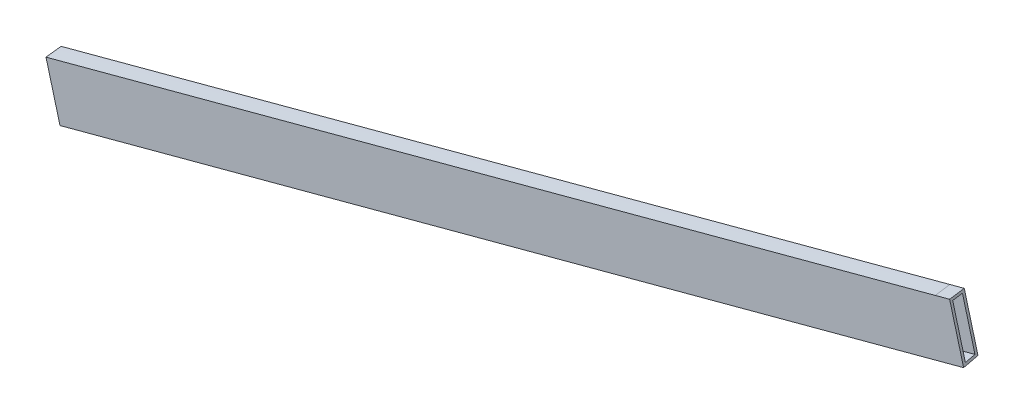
ISO-10303-21;
HEADER;
FILE_DESCRIPTION(('STEP AP214'),'2;1');
FILE_NAME('part.step','',(''),(''),'','','');
FILE_SCHEMA(('AUTOMOTIVE_DESIGN { 1 0 10303 214 1 1 1 1 }'));
ENDSEC;
DATA;
#1=APPLICATION_CONTEXT('core data for automotive mechanical design processes');
#2=APPLICATION_PROTOCOL_DEFINITION('international standard','automotive_design',2000,#1);
#3=PRODUCT_CONTEXT('',#1,'mechanical');
#4=PRODUCT('Part','Part','',(#3));
#5=PRODUCT_RELATED_PRODUCT_CATEGORY('part','',(#4));
#6=PRODUCT_DEFINITION_FORMATION('','',#4);
#7=PRODUCT_DEFINITION_CONTEXT('part definition',#1,'design');
#8=PRODUCT_DEFINITION('design','',#6,#7);
#9=PRODUCT_DEFINITION_SHAPE('','',#8);
#10=(LENGTH_UNIT() NAMED_UNIT(*) SI_UNIT(.MILLI.,.METRE.));
#11=(NAMED_UNIT(*) PLANE_ANGLE_UNIT() SI_UNIT($,.RADIAN.));
#12=(NAMED_UNIT(*) SI_UNIT($,.STERADIAN.) SOLID_ANGLE_UNIT());
#13=UNCERTAINTY_MEASURE_WITH_UNIT(LENGTH_MEASURE(1.E-05),#10,'distance_accuracy_value','');
#14=(GEOMETRIC_REPRESENTATION_CONTEXT(3) GLOBAL_UNCERTAINTY_ASSIGNED_CONTEXT((#13)) GLOBAL_UNIT_ASSIGNED_CONTEXT((#10,
#11,#12)) REPRESENTATION_CONTEXT('',''));
#15=CARTESIAN_POINT('',(0.,0.,0.));
#16=DIRECTION('',(0.,0.,1.));
#17=DIRECTION('',(1.,0.,0.));
#18=AXIS2_PLACEMENT_3D('',#15,#16,#17);
#19=CARTESIAN_POINT('',(25.4,18.2236431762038,-32.54375));
#20=CARTESIAN_POINT('',(310.61406,94.6465202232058,-32.54375));
#21=CARTESIAN_POINT('',(25.4,18.374784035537,-33.5991378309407));
#22=CARTESIAN_POINT('',(310.61406,94.797661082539,-33.5991378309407));
#23=CARTESIAN_POINT('',(25.4,18.5040045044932,-34.6579138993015));
#24=CARTESIAN_POINT('',(310.61406,94.9268815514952,-34.6579138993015));
#25=CARTESIAN_POINT('',(25.4,18.6103708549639,-35.71875));
#26=CARTESIAN_POINT('',(310.61406,95.0332479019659,-35.71875));
#27=B_SPLINE_SURFACE_WITH_KNOTS('',3,1,((#19,#20),(#21,#22),(#23,#24),(#25,#26)),.UNSPECIFIED.,
.F.,.F.,.F.,(4,4),(2,2),(0.,1.),(0.,1.),.UNSPECIFIED.);
#28=CARTESIAN_POINT('',(25.4753621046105,18.6305640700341,-35.71875));
#29=CARTESIAN_POINT('',(25.4820153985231,18.6057336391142,-35.4533282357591));
#30=CARTESIAN_POINT('',(25.4890260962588,18.5795693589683,-35.1880414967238));
#31=CARTESIAN_POINT('',(25.5037556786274,18.5245978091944,-34.6577616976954));
#32=CARTESIAN_POINT('',(25.5114745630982,18.4957905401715,-34.3927686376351));
#33=CARTESIAN_POINT('',(25.5356548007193,18.4055486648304,-33.5992094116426));
#34=CARTESIAN_POINT('',(25.5531635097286,18.3402052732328,-33.0711167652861));
#35=CARTESIAN_POINT('',(25.5720440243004,18.2697422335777,-32.54375));
#36=B_SPLINE_CURVE_WITH_KNOTS('',3,(#28,#29,#30,#31,#32,#33,#34,#35),.UNSPECIFIED.,.F.,.F.,(4,2,
2,4),(0.,0.799985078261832,1.59996997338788,3.19708769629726),.UNSPECIFIED.);
#37=CARTESIAN_POINT('',(25.4753621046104,18.6305640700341,-35.71875));
#38=VERTEX_POINT('',#37);
#39=CARTESIAN_POINT('',(25.5720440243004,18.2697422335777,-32.54375));
#40=VERTEX_POINT('',#39);
#41=EDGE_CURVE('E11',#38,#40,#36,.T.);
#42=DIRECTION('',(0.965925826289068,0.258819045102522,0.));
#43=VECTOR('',#42,1.);
#44=CARTESIAN_POINT('',(25.4,18.6103708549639,-35.71875));
#45=LINE('',#44,#43);
#46=CARTESIAN_POINT('',(306.268336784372,93.8688148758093,-35.71875));
#47=VERTEX_POINT('',#46);
#48=EDGE_CURVE('E239',#38,#47,#45,.T.);
#49=CARTESIAN_POINT('',(306.365018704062,93.5079930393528,-32.54375));
#50=CARTESIAN_POINT('',(306.355561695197,93.543287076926,-32.8078977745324));
#51=CARTESIAN_POINT('',(306.346448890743,93.5772965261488,-33.0722290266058));
#52=CARTESIAN_POINT('',(306.328918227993,93.6427218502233,-33.6012353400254));
#53=CARTESIAN_POINT('',(306.320500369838,93.6741377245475,-33.8659104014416));
#54=CARTESIAN_POINT('',(306.296327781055,93.7643510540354,-34.6594724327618));
#55=CARTESIAN_POINT('',(306.281620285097,93.8192401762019,-35.1888379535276));
#56=CARTESIAN_POINT('',(306.268336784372,93.8688148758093,-35.71875));
#57=B_SPLINE_CURVE_WITH_KNOTS('',3,(#49,#50,#51,#52,#53,#54,#55,#56),.UNSPECIFIED.,.F.,.F.,(4,2,
2,4),(0.,0.799984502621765,1.59996916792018,3.19708700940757),.UNSPECIFIED.);
#58=CARTESIAN_POINT('',(306.365018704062,93.5079930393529,-32.54375));
#59=VERTEX_POINT('',#58);
#60=EDGE_CURVE('E43',#59,#47,#57,.T.);
#61=DIRECTION('',(0.965925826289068,0.258819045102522,0.));
#62=VECTOR('',#61,1.);
#63=CARTESIAN_POINT('',(25.4,18.2236431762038,-32.54375));
#64=LINE('',#63,#62);
#65=EDGE_CURVE('E213',#40,#59,#64,.T.);
#66=ORIENTED_EDGE('',*,*,#41,.F.);
#67=ORIENTED_EDGE('',*,*,#48,.T.);
#68=ORIENTED_EDGE('',*,*,#60,.F.);
#69=ORIENTED_EDGE('',*,*,#65,.F.);
#70=EDGE_LOOP('',(#66,#67,#68,#69));
#71=FACE_BOUND('',#70,.T.);
#72=ADVANCED_FACE('F33',(#71),#27,.T.);
#73=CARTESIAN_POINT('',(25.4,18.2236431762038,-32.54375));
#74=DIRECTION('',(0.,0.,-1.));
#75=DIRECTION('',(-1.,0.,0.));
#76=AXIS2_PLACEMENT_3D('',#73,#74,#75);
#77=PLANE('',#76);
#78=DIRECTION('',(0.258819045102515,-0.96592582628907,0.));
#79=VECTOR('',#78,1.);
#80=CARTESIAN_POINT('',(25.5720440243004,18.2697422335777,-32.54375));
#81=LINE('',#80,#79);
#82=CARTESIAN_POINT('',(29.5814012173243,3.30661748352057,-32.54375));
#83=VERTEX_POINT('',#82);
#84=EDGE_CURVE('E214',#40,#83,#81,.T.);
#85=ORIENTED_EDGE('',*,*,#84,.F.);
#86=ORIENTED_EDGE('',*,*,#65,.T.);
#87=DIRECTION('',(-0.96592582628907,-0.258819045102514,0.));
#88=VECTOR('',#87,1.);
#89=CARTESIAN_POINT('',(310.903904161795,94.7241837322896,-32.54375));
#90=LINE('',#89,#88);
#91=CARTESIAN_POINT('',(310.903904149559,94.7241837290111,-32.54375));
#92=VERTEX_POINT('',#91);
#93=EDGE_CURVE('E170',#92,#59,#90,.T.);
#94=ORIENTED_EDGE('',*,*,#93,.F.);
#95=DIRECTION('',(0.258819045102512,-0.965925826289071,0.));
#96=VECTOR('',#95,1.);
#97=CARTESIAN_POINT('',(314.913261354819,79.7610589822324,-32.54375));
#98=LINE('',#97,#96);
#99=CARTESIAN_POINT('',(314.913261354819,79.7610589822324,-32.54375));
#100=VERTEX_POINT('',#99);
#101=EDGE_CURVE('E160',#92,#100,#98,.T.);
#102=ORIENTED_EDGE('',*,*,#101,.T.);
#103=DIRECTION('',(-0.96592582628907,-0.258819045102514,0.));
#104=VECTOR('',#103,1.);
#105=CARTESIAN_POINT('',(314.913261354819,79.7610589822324,-32.54375));
#106=LINE('',#105,#104);
#107=CARTESIAN_POINT('',(310.374375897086,78.5448682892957,-32.54375));
#108=VERTEX_POINT('',#107);
#109=EDGE_CURVE('E136',#100,#108,#106,.T.);
#110=ORIENTED_EDGE('',*,*,#109,.T.);
#111=DIRECTION('',(0.965925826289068,0.258819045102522,0.));
#112=VECTOR('',#111,1.);
#113=CARTESIAN_POINT('',(25.4,2.18621440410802,-32.54375));
#114=LINE('',#113,#112);
#115=EDGE_CURVE('E216',#83,#108,#114,.T.);
#116=ORIENTED_EDGE('',*,*,#115,.F.);
#117=EDGE_LOOP('',(#85,#86,#94,#102,#110,#116));
#118=FACE_BOUND('',#117,.T.);
#119=ADVANCED_FACE('F209',(#118),#77,.T.);
#120=CARTESIAN_POINT('',(25.4,2.78680767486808,-35.7187499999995));
#121=CARTESIAN_POINT('',(310.61406,79.2096847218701,-35.7187499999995));
#122=CARTESIAN_POINT('',(25.4,2.58767763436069,-34.6602152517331));
#123=CARTESIAN_POINT('',(310.61406,79.0105546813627,-34.6602152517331));
#124=CARTESIAN_POINT('',(25.4,2.3872384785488,-33.6019266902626));
#125=CARTESIAN_POINT('',(310.61406,78.8101155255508,-33.6019266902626));
#126=CARTESIAN_POINT('',(25.4,2.18621440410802,-32.54375));
#127=CARTESIAN_POINT('',(310.61406,78.60909145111,-32.54375));
#128=B_SPLINE_SURFACE_WITH_KNOTS('',3,1,((#120,#121),(#122,#123),(#124,#125),(#126,#127)),
.UNSPECIFIED.,.F.,.F.,.F.,(4,4),(2,2),(0.,1.),(0.,1.),.UNSPECIFIED.);
#129=CARTESIAN_POINT('',(29.5814012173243,3.30661748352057,-32.54375));
#130=CARTESIAN_POINT('',(29.568822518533,3.35356182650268,-32.8086035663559));
#131=CARTESIAN_POINT('',(29.5562530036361,3.40047189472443,-33.0734636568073));
#132=CARTESIAN_POINT('',(29.5311380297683,3.49420225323,-33.6032008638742));
#133=CARTESIAN_POINT('',(29.5185925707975,3.54102254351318,-33.8680779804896));
#134=CARTESIAN_POINT('',(29.481058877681,3.68110019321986,-34.6615133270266));
#135=CARTESIAN_POINT('',(29.4561149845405,3.77419206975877,-35.19010286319));
#136=CARTESIAN_POINT('',(29.4312528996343,3.86697863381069,-35.7187499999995));
#137=B_SPLINE_CURVE_WITH_KNOTS('',3,(#129,#130,#131,#132,#133,#134,#135,#136),.UNSPECIFIED.,.F.,
.F.,(4,2,2,4),(0.,0.807827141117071,1.61565428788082,3.22756506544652),.UNSPECIFIED.);
#138=CARTESIAN_POINT('',(29.4312528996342,3.86697863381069,-35.7187499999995));
#139=VERTEX_POINT('',#138);
#140=EDGE_CURVE('E408',#83,#139,#137,.T.);
#141=CARTESIAN_POINT('',(310.224227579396,79.1052294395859,-35.7187499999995));
#142=CARTESIAN_POINT('',(310.236687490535,79.0587284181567,-35.4538125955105));
#143=CARTESIAN_POINT('',(310.249167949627,79.0121507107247,-35.1888896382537));
#144=CARTESIAN_POINT('',(310.274164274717,78.9188631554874,-34.6590686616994));
#145=CARTESIAN_POINT('',(310.286680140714,78.8721533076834,-34.3941706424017));
#146=CARTESIAN_POINT('',(310.324214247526,78.732074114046,-33.6007355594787));
#147=CARTESIAN_POINT('',(310.349276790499,78.6385394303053,-33.072229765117));
#148=CARTESIAN_POINT('',(310.374375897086,78.5448682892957,-32.54375));
#149=B_SPLINE_CURVE_WITH_KNOTS('',3,(#141,#142,#143,#144,#145,#146,#147,#148),.UNSPECIFIED.,.F.,
.F.,(4,2,2,4),(0.,0.807827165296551,1.61565432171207,3.22756509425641),.UNSPECIFIED.);
#150=CARTESIAN_POINT('',(310.224227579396,79.1052294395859,-35.7187499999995));
#151=VERTEX_POINT('',#150);
#152=EDGE_CURVE('E37',#151,#108,#149,.T.);
#153=DIRECTION('',(0.965925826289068,0.258819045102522,0.));
#154=VECTOR('',#153,1.);
#155=CARTESIAN_POINT('',(25.4,2.78680767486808,-35.7187499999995));
#156=LINE('',#155,#154);
#157=EDGE_CURVE('E149',#139,#151,#156,.T.);
#158=ORIENTED_EDGE('',*,*,#140,.F.);
#159=ORIENTED_EDGE('',*,*,#115,.T.);
#160=ORIENTED_EDGE('',*,*,#152,.F.);
#161=ORIENTED_EDGE('',*,*,#157,.F.);
#162=EDGE_LOOP('',(#158,#159,#160,#161));
#163=FACE_BOUND('',#162,.T.);
#164=ADVANCED_FACE('F416',(#163),#128,.T.);
#165=CARTESIAN_POINT('',(25.4,2.78680767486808,-35.7187499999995));
#166=DIRECTION('',(0.,0.,1.));
#167=DIRECTION('',(0.,-1.,0.));
#168=AXIS2_PLACEMENT_3D('',#165,#166,#167);
#169=PLANE('',#168);
#170=DIRECTION('',(-0.258819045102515,0.96592582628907,0.));
#171=VECTOR('',#170,1.);
#172=CARTESIAN_POINT('',(29.4312528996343,3.86697863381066,-35.7187499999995));
#173=LINE('',#172,#171);
#174=EDGE_CURVE('E58',#139,#38,#173,.T.);
#175=ORIENTED_EDGE('',*,*,#174,.F.);
#176=ORIENTED_EDGE('',*,*,#157,.T.);
#177=DIRECTION('',(-0.96592582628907,-0.258819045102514,0.));
#178=VECTOR('',#177,1.);
#179=CARTESIAN_POINT('',(314.763113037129,80.3214201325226,-35.7187499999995));
#180=LINE('',#179,#178);
#181=CARTESIAN_POINT('',(314.763113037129,80.3214201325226,-35.7187499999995));
#182=VERTEX_POINT('',#181);
#183=EDGE_CURVE('E134',#182,#151,#180,.T.);
#184=ORIENTED_EDGE('',*,*,#183,.F.);
#185=DIRECTION('',(-0.258819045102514,0.96592582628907,0.));
#186=VECTOR('',#185,1.);
#187=CARTESIAN_POINT('',(310.807222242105,95.085005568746,-35.71875));
#188=LINE('',#187,#186);
#189=CARTESIAN_POINT('',(310.807222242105,95.085005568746,-35.71875));
#190=VERTEX_POINT('',#189);
#191=EDGE_CURVE('E141',#182,#190,#188,.T.);
#192=ORIENTED_EDGE('',*,*,#191,.T.);
#193=DIRECTION('',(-0.96592582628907,-0.258819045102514,0.));
#194=VECTOR('',#193,1.);
#195=CARTESIAN_POINT('',(310.807222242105,95.085005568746,-35.71875));
#196=LINE('',#195,#194);
#197=EDGE_CURVE('E152',#190,#47,#196,.T.);
#198=ORIENTED_EDGE('',*,*,#197,.T.);
#199=ORIENTED_EDGE('',*,*,#48,.F.);
#200=EDGE_LOOP('',(#175,#176,#184,#192,#198,#199));
#201=FACE_BOUND('',#200,.T.);
#202=ADVANCED_FACE('F145',(#201),#169,.T.);
#203=CARTESIAN_POINT('',(25.4,18.9118192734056,-57.15));
#204=DIRECTION('',(0.96592582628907,0.258819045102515,0.));
#205=DIRECTION('',(-0.258819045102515,0.96592582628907,0.));
#206=AXIS2_PLACEMENT_3D('',#203,#204,#205);
#207=PLANE('',#206);
#208=CARTESIAN_POINT('',(29.595841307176,3.25272633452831,-36.5124999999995));
#209=CARTESIAN_POINT('',(29.614531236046,3.18297457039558,-36.1150925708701));
#210=CARTESIAN_POINT('',(29.6332532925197,3.11310290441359,-35.7177077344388));
#211=CARTESIAN_POINT('',(29.6707518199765,2.9731564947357,-34.9229763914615));
#212=CARTESIAN_POINT('',(29.6895282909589,2.90308175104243,-34.5256298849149));
#213=CARTESIAN_POINT('',(29.745837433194,2.69293317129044,-33.3354791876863));
#214=CARTESIAN_POINT('',(29.7834365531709,2.55261134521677,-32.5427219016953));
#215=CARTESIAN_POINT('',(29.8210853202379,2.41210423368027,-31.75));
#216=B_SPLINE_CURVE_WITH_KNOTS('',3,(#208,#209,#210,#211,#212,#213,#214,#215),.UNSPECIFIED.,.F.,
.F.,(4,2,2,4),(0.,1.21174477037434,2.42348952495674,4.84136260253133),.UNSPECIFIED.);
#217=CARTESIAN_POINT('',(29.595841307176,3.25272633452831,-36.5124999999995));
#218=VERTEX_POINT('',#217);
#219=CARTESIAN_POINT('',(29.8210853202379,2.41210423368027,-31.75));
#220=VERTEX_POINT('',#219);
#221=EDGE_CURVE('E302',#218,#220,#216,.T.);
#222=ORIENTED_EDGE('',*,*,#221,.T.);
#223=DIRECTION('',(-0.258819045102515,0.96592582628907,0.));
#224=VECTOR('',#223,1.);
#225=CARTESIAN_POINT('',(25.4,18.9118192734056,-31.75));
#226=LINE('',#225,#224);
#227=CARTESIAN_POINT('',(25.4,18.9118192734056,-31.75));
#228=VERTEX_POINT('',#227);
#229=EDGE_CURVE('E304',#220,#228,#226,.T.);
#230=ORIENTED_EDGE('',*,*,#229,.T.);
#231=DIRECTION('',(0.,0.,1.));
#232=VECTOR('',#231,1.);
#233=CARTESIAN_POINT('',(25.4,18.9118192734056,-57.15));
#234=LINE('',#233,#232);
#235=CARTESIAN_POINT('',(25.4,18.9118192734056,-36.5124999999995));
#236=VERTEX_POINT('',#235);
#237=EDGE_CURVE('E305',#236,#228,#234,.T.);
#238=ORIENTED_EDGE('',*,*,#237,.F.);
#239=DIRECTION('',(0.258819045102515,-0.96592582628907,0.));
#240=VECTOR('',#239,1.);
#241=CARTESIAN_POINT('',(29.595841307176,3.25272633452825,-36.5124999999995));
#242=LINE('',#241,#240);
#243=EDGE_CURVE('E470',#236,#218,#242,.T.);
#244=ORIENTED_EDGE('',*,*,#243,.T.);
#245=EDGE_LOOP('',(#222,#230,#238,#244));
#246=FACE_BOUND('',#245,.T.);
#247=ORIENTED_EDGE('',*,*,#174,.T.);
#248=ORIENTED_EDGE('',*,*,#41,.T.);
#249=ORIENTED_EDGE('',*,*,#84,.T.);
#250=ORIENTED_EDGE('',*,*,#140,.T.);
#251=EDGE_LOOP('',(#247,#248,#249,#250));
#252=FACE_BOUND('',#251,.T.);
#253=ADVANCED_FACE('F249',(#246,#252),#207,.F.);
#254=CARTESIAN_POINT('',(25.4,19.4876873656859,-36.5124999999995));
#255=CARTESIAN_POINT('',(310.61406,95.9105644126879,-36.5124999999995));
#256=CARTESIAN_POINT('',(25.4,19.3281547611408,-34.9214146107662));
#257=CARTESIAN_POINT('',(310.61406,95.7510318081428,-34.9214146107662));
#258=CARTESIAN_POINT('',(25.4,19.1385065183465,-33.3329138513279));
#259=CARTESIAN_POINT('',(310.61406,95.5613835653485,-33.3329138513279));
#260=CARTESIAN_POINT('',(25.4,18.9118192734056,-31.75));
#261=CARTESIAN_POINT('',(310.61406,95.3346963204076,-31.75));
#262=B_SPLINE_SURFACE_WITH_KNOTS('',3,1,((#254,#255),(#256,#257),(#258,#259),(#260,#261)),
.UNSPECIFIED.,.F.,.F.,.F.,(4,4),(2,2),(0.,1.),(0.,1.),.UNSPECIFIED.);
#263=CARTESIAN_POINT('',(306.049007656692,94.6873623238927,-36.5124999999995));
#264=CARTESIAN_POINT('',(306.058986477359,94.650120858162,-36.1144127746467));
#265=CARTESIAN_POINT('',(306.069436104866,94.6111223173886,-35.7164993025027));
#266=CARTESIAN_POINT('',(306.091332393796,94.5294042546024,-34.9210819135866));
#267=CARTESIAN_POINT('',(306.102779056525,94.4866847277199,-34.5235779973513));
#268=CARTESIAN_POINT('',(306.138655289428,94.3527928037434,-33.333182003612));
#269=CARTESIAN_POINT('',(306.164656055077,94.2557566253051,-32.5409955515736));
#270=CARTESIAN_POINT('',(306.192974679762,94.1500700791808,-31.75));
#271=B_SPLINE_CURVE_WITH_KNOTS('',3,(#263,#264,#265,#266,#267,#268,#269,#270),.UNSPECIFIED.,.F.,
.F.,(4,2,2,4),(0.,1.19984922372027,2.39970001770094,4.79515275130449),.UNSPECIFIED.);
#272=CARTESIAN_POINT('',(306.049007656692,94.6873623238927,-36.5124999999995));
#273=VERTEX_POINT('',#272);
#274=CARTESIAN_POINT('',(306.192974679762,94.1500700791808,-31.75));
#275=VERTEX_POINT('',#274);
#276=EDGE_CURVE('E409',#273,#275,#271,.T.);
#277=DIRECTION('',(0.965925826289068,0.258819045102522,0.));
#278=VECTOR('',#277,1.);
#279=CARTESIAN_POINT('',(25.4,19.4876873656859,-36.5124999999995));
#280=LINE('',#279,#278);
#281=CARTESIAN_POINT('',(25.4,19.4876873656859,-36.5124999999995));
#282=VERTEX_POINT('',#281);
#283=EDGE_CURVE('E443',#282,#273,#280,.T.);
#284=CARTESIAN_POINT('',(25.4,19.4876873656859,-36.5124999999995));
#285=CARTESIAN_POINT('',(25.4,19.3281547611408,-34.9214146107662));
#286=CARTESIAN_POINT('',(25.4,19.1385065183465,-33.3329138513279));
#287=CARTESIAN_POINT('',(25.4,18.9118192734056,-31.75));
#288=B_SPLINE_CURVE_WITH_KNOTS('',3,(#284,#285,#286,#287),.UNSPECIFIED.,.F.,.F.,(4,4),
(0.367800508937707,0.383533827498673),.UNSPECIFIED.);
#289=EDGE_CURVE('E472',#282,#228,#288,.T.);
#290=DIRECTION('',(0.965925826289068,0.258819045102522,0.));
#291=VECTOR('',#290,1.);
#292=CARTESIAN_POINT('',(25.4,18.9118192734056,-31.75));
#293=LINE('',#292,#291);
#294=EDGE_CURVE('E445',#228,#275,#293,.T.);
#295=ORIENTED_EDGE('',*,*,#276,.F.);
#296=ORIENTED_EDGE('',*,*,#283,.F.);
#297=ORIENTED_EDGE('',*,*,#289,.T.);
#298=ORIENTED_EDGE('',*,*,#294,.T.);
#299=EDGE_LOOP('',(#295,#296,#297,#298));
#300=FACE_BOUND('',#299,.T.);
#301=ADVANCED_FACE('F382',(#300),#262,.T.);
#302=CARTESIAN_POINT('',(25.4,18.9118192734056,-31.75));
#303=DIRECTION('',(0.,0.,1.));
#304=DIRECTION('',(0.,-1.,0.));
#305=AXIS2_PLACEMENT_3D('',#302,#303,#304);
#306=PLANE('',#305);
#307=ORIENTED_EDGE('',*,*,#229,.F.);
#308=DIRECTION('',(0.965925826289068,0.258819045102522,0.));
#309=VECTOR('',#308,1.);
#310=CARTESIAN_POINT('',(25.4,1.2274779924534,-31.75));
#311=LINE('',#310,#309);
#312=CARTESIAN_POINT('',(310.61406,77.6503550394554,-31.75));
#313=VERTEX_POINT('',#312);
#314=EDGE_CURVE('E457',#220,#313,#311,.T.);
#315=ORIENTED_EDGE('',*,*,#314,.T.);
#316=DIRECTION('',(-0.96592582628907,-0.258819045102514,0.));
#317=VECTOR('',#316,1.);
#318=CARTESIAN_POINT('',(315.152945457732,78.8665457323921,-31.75));
#319=LINE('',#318,#317);
#320=CARTESIAN_POINT('',(315.152945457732,78.8665457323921,-31.75));
#321=VERTEX_POINT('',#320);
#322=EDGE_CURVE('E491',#321,#313,#319,.T.);
#323=ORIENTED_EDGE('',*,*,#322,.F.);
#324=DIRECTION('',(0.258819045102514,-0.96592582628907,0.));
#325=VECTOR('',#324,1.);
#326=CARTESIAN_POINT('',(310.731860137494,95.3662607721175,-31.75));
#327=LINE('',#326,#325);
#328=CARTESIAN_POINT('',(310.731860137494,95.3662607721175,-31.75));
#329=VERTEX_POINT('',#328);
#330=EDGE_CURVE('E493',#329,#321,#327,.T.);
#331=ORIENTED_EDGE('',*,*,#330,.F.);
#332=DIRECTION('',(-0.96592582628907,-0.258819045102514,0.));
#333=VECTOR('',#332,1.);
#334=CARTESIAN_POINT('',(310.731860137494,95.3662607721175,-31.75));
#335=LINE('',#334,#333);
#336=EDGE_CURVE('E318',#329,#275,#335,.T.);
#337=ORIENTED_EDGE('',*,*,#336,.T.);
#338=ORIENTED_EDGE('',*,*,#294,.F.);
#339=EDGE_LOOP('',(#307,#315,#323,#331,#337,#338));
#340=FACE_BOUND('',#339,.T.);
#341=ADVANCED_FACE('F285',(#340),#306,.T.);
#342=CARTESIAN_POINT('',(25.4,1.2274779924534,-31.75));
#343=CARTESIAN_POINT('',(310.61406,77.6503550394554,-31.75));
#344=CARTESIAN_POINT('',(25.4,1.52901510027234,-33.3372702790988));
#345=CARTESIAN_POINT('',(310.61406,77.9518921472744,-33.3372702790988));
#346=CARTESIAN_POINT('',(25.4,1.82975799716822,-34.9246926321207));
#347=CARTESIAN_POINT('',(310.61406,78.2526350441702,-34.9246926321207));
#348=CARTESIAN_POINT('',(25.4,2.12845404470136,-36.5124999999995));
#349=CARTESIAN_POINT('',(310.61406,78.5513310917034,-36.5124999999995));
#350=B_SPLINE_SURFACE_WITH_KNOTS('',3,1,((#342,#343),(#344,#345),(#346,#347),(#348,#349)),
.UNSPECIFIED.,.F.,.F.,.F.,(4,4),(2,2),(0.,1.),(0.,1.),.UNSPECIFIED.);
#351=DIRECTION('',(0.965925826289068,0.258819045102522,0.));
#352=VECTOR('',#351,1.);
#353=CARTESIAN_POINT('',(25.4,2.12845404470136,-36.5124999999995));
#354=LINE('',#353,#352);
#355=CARTESIAN_POINT('',(310.388815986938,78.4909771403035,-36.5124999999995));
#356=VERTEX_POINT('',#355);
#357=EDGE_CURVE('E51',#218,#356,#354,.T.);
#358=CARTESIAN_POINT('',(310.61406,77.6503550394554,-31.75));
#359=CARTESIAN_POINT('',(310.595191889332,77.720771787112,-32.1472816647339));
#360=CARTESIAN_POINT('',(310.576336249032,77.7911419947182,-32.5445721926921));
#361=CARTESIAN_POINT('',(310.53865974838,77.9317526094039,-33.3391778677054));
#362=CARTESIAN_POINT('',(310.519838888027,78.0019930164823,-33.7364930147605));
#363=CARTESIAN_POINT('',(310.463530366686,78.2121392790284,-34.926644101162));
#364=CARTESIAN_POINT('',(310.426109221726,78.3517968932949,-35.7195270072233));
#365=CARTESIAN_POINT('',(310.388815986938,78.4909771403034,-36.5124999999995));
#366=B_SPLINE_CURVE_WITH_KNOTS('',3,(#358,#359,#360,#361,#362,#363,#364,#365),.UNSPECIFIED.,.F.,
.F.,(4,2,2,4),(0.,1.21174472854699,2.42348946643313,4.84136255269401),.UNSPECIFIED.);
#367=EDGE_CURVE('E329',#313,#356,#366,.T.);
#368=ORIENTED_EDGE('',*,*,#221,.F.);
#369=ORIENTED_EDGE('',*,*,#357,.T.);
#370=ORIENTED_EDGE('',*,*,#367,.F.);
#371=ORIENTED_EDGE('',*,*,#314,.F.);
#372=EDGE_LOOP('',(#368,#369,#370,#371));
#373=FACE_BOUND('',#372,.T.);
#374=ADVANCED_FACE('F279',(#373),#350,.T.);
#375=CARTESIAN_POINT('',(25.4,2.12845404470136,-36.5124999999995));
#376=DIRECTION('',(0.,0.,-1.));
#377=DIRECTION('',(0.,1.,0.));
#378=AXIS2_PLACEMENT_3D('',#375,#376,#377);
#379=PLANE('',#378);
#380=ORIENTED_EDGE('',*,*,#243,.F.);
#381=DIRECTION('',(0.,1.,0.));
#382=VECTOR('',#381,1.);
#383=CARTESIAN_POINT('',(25.4,2.12845404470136,-36.5124999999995));
#384=LINE('',#383,#382);
#385=EDGE_CURVE('E469',#236,#282,#384,.T.);
#386=ORIENTED_EDGE('',*,*,#385,.T.);
#387=ORIENTED_EDGE('',*,*,#283,.T.);
#388=DIRECTION('',(-0.96592582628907,-0.258819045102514,0.));
#389=VECTOR('',#388,1.);
#390=CARTESIAN_POINT('',(310.587893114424,95.9035530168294,-36.5124999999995));
#391=LINE('',#390,#389);
#392=CARTESIAN_POINT('',(310.587893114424,95.9035530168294,-36.5124999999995));
#393=VERTEX_POINT('',#392);
#394=EDGE_CURVE('E312',#393,#273,#391,.T.);
#395=ORIENTED_EDGE('',*,*,#394,.F.);
#396=DIRECTION('',(-0.258819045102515,0.96592582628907,0.));
#397=VECTOR('',#396,1.);
#398=CARTESIAN_POINT('',(314.92770144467,79.7071678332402,-36.5124999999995));
#399=LINE('',#398,#397);
#400=CARTESIAN_POINT('',(314.92770144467,79.7071678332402,-36.5124999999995));
#401=VERTEX_POINT('',#400);
#402=EDGE_CURVE('E466',#401,#393,#399,.T.);
#403=ORIENTED_EDGE('',*,*,#402,.F.);
#404=DIRECTION('',(-0.96592582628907,-0.258819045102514,0.));
#405=VECTOR('',#404,1.);
#406=CARTESIAN_POINT('',(314.92770144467,79.7071678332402,-36.5124999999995));
#407=LINE('',#406,#405);
#408=EDGE_CURVE('E306',#401,#356,#407,.T.);
#409=ORIENTED_EDGE('',*,*,#408,.T.);
#410=ORIENTED_EDGE('',*,*,#357,.F.);
#411=EDGE_LOOP('',(#380,#386,#387,#395,#403,#409,#410));
#412=FACE_BOUND('',#411,.T.);
#413=ADVANCED_FACE('F35',(#412),#379,.T.);
#414=CARTESIAN_POINT('',(25.4,19.2249363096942,-34.1281856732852));
#415=DIRECTION('',(-1.,0.,0.));
#416=DIRECTION('',(0.,0.,1.));
#417=AXIS2_PLACEMENT_3D('',#414,#415,#416);
#418=PLANE('',#417);
#419=ORIENTED_EDGE('',*,*,#237,.T.);
#420=ORIENTED_EDGE('',*,*,#289,.F.);
#421=ORIENTED_EDGE('',*,*,#385,.F.);
#422=EDGE_LOOP('',(#419,#420,#421));
#423=FACE_BOUND('',#422,.T.);
#424=ADVANCED_FACE('F381',(#423),#418,.T.);
#425=CARTESIAN_POINT('',(315.040056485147,79.2878531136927,-34.1310616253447));
#426=DIRECTION('',(0.96592582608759,0.258819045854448,1.42730299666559E-10));
#427=DIRECTION('',(-0.258819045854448,0.96592582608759,0.));
#428=AXIS2_PLACEMENT_3D('',#425,#426,#427);
#429=PLANE('',#428);
#430=CARTESIAN_POINT('',(314.92770144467,79.7071678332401,-36.5124999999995));
#431=CARTESIAN_POINT('',(314.964994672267,79.5679876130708,-35.7195271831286));
#432=CARTESIAN_POINT('',(315.002415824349,79.4283299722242,-34.9266441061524));
#433=CARTESIAN_POINT('',(315.03992579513,79.2883408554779,-34.1338239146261));
#434=CARTESIAN_POINT('',(315.058724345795,79.2181837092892,-33.7364930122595));
#435=CARTESIAN_POINT('',(315.077545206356,79.1479433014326,-33.3391778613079));
#436=CARTESIAN_POINT('',(315.096383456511,79.0776379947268,-32.9418750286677));
#437=CARTESIAN_POINT('',(315.115221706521,79.0073326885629,-32.5445721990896));
#438=CARTESIAN_POINT('',(315.134077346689,78.9369624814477,-32.1472816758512));
#439=CARTESIAN_POINT('',(315.152945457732,78.8665457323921,-31.75));
#440=B_SPLINE_CURVE_WITH_KNOTS('',3,(#430,#431,#432,#433,#434,#435,#436,#437,#438,#439),
.UNSPECIFIED.,.F.,.F.,(4,3,3,4),(0.,0.00241787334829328,0.00362961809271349,
0.00484136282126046),.UNSPECIFIED.);
#441=EDGE_CURVE('E151',#321,#401,#440,.F.);
#442=ORIENTED_EDGE('',*,*,#441,.T.);
#443=ORIENTED_EDGE('',*,*,#402,.T.);
#444=CARTESIAN_POINT('',(310.731860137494,95.3662607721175,-31.75));
#445=CARTESIAN_POINT('',(310.675172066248,95.5778235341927,-33.333368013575));
#446=CARTESIAN_POINT('',(310.62777395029,95.7547157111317,-34.9215069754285));
#447=CARTESIAN_POINT('',(310.587893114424,95.9035530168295,-36.5124999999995));
#448=B_SPLINE_CURVE_WITH_KNOTS('',3,(#444,#445,#446,#447),.UNSPECIFIED.,.F.,.F.,(4,4),(0.,1.),.UNSPECIFIED.);
#449=EDGE_CURVE('E368',#393,#329,#448,.F.);
#450=ORIENTED_EDGE('',*,*,#449,.T.);
#451=ORIENTED_EDGE('',*,*,#330,.T.);
#452=EDGE_LOOP('',(#442,#443,#450,#451));
#453=FACE_BOUND('',#452,.T.);
#454=ORIENTED_EDGE('',*,*,#191,.F.);
#455=CARTESIAN_POINT('',(314.913261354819,79.7610589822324,-32.54375));
#456=CARTESIAN_POINT('',(314.888162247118,79.8547301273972,-33.0722298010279));
#457=CARTESIAN_POINT('',(314.863099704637,79.9482648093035,-33.6007355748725));
#458=CARTESIAN_POINT('',(314.838096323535,80.0415786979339,-34.1292831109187));
#459=CARTESIAN_POINT('',(314.825565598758,80.0883439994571,-34.3941706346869));
#460=CARTESIAN_POINT('',(314.813049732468,80.1350538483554,-34.6590686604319));
#461=CARTESIAN_POINT('',(314.800551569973,80.1816976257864,-34.9239791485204));
#462=CARTESIAN_POINT('',(314.788053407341,80.2283414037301,-35.1888896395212));
#463=CARTESIAN_POINT('',(314.775572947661,80.2749191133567,-35.4538126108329));
#464=CARTESIAN_POINT('',(314.763113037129,80.3214201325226,-35.7187499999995));
#465=B_SPLINE_CURVE_WITH_KNOTS('',3,(#455,#456,#457,#458,#459,#460,#461,#462,#463,#464),
.UNSPECIFIED.,.F.,.F.,(4,3,3,4),(0.,0.00161191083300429,0.00241973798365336,
0.00322756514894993),.UNSPECIFIED.);
#466=EDGE_CURVE('E129',#100,#182,#465,.T.);
#467=ORIENTED_EDGE('',*,*,#466,.F.);
#468=ORIENTED_EDGE('',*,*,#101,.F.);
#469=CARTESIAN_POINT('',(310.807222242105,95.085005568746,-35.71875));
#470=CARTESIAN_POINT('',(310.833812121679,94.985770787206,-34.6579820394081));
#471=CARTESIAN_POINT('',(310.866108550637,94.8652388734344,-33.5994282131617));
#472=CARTESIAN_POINT('',(310.903904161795,94.7241837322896,-32.54375));
#473=B_SPLINE_CURVE_WITH_KNOTS('',3,(#469,#470,#471,#472),.UNSPECIFIED.,.F.,.F.,(4,4),(0.,1.),.UNSPECIFIED.);
#474=EDGE_CURVE('E157',#190,#92,#473,.T.);
#475=ORIENTED_EDGE('',*,*,#474,.F.);
#476=EDGE_LOOP('',(#454,#467,#468,#475));
#477=FACE_BOUND('',#476,.T.);
#478=ADVANCED_FACE('F155',(#453,#477),#429,.T.);
#479=CARTESIAN_POINT('',(315.152945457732,78.8665457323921,-31.75));
#480=CARTESIAN_POINT('',(315.134077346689,78.9369624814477,-32.1472816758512));
#481=CARTESIAN_POINT('',(315.115221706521,79.0073326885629,-32.5445721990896));
#482=CARTESIAN_POINT('',(315.096383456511,79.0776379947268,-32.9418750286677));
#483=CARTESIAN_POINT('',(315.077545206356,79.1479433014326,-33.3391778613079));
#484=CARTESIAN_POINT('',(315.058724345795,79.2181837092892,-33.7364930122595));
#485=CARTESIAN_POINT('',(315.03992579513,79.2883408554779,-34.1338239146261));
#486=CARTESIAN_POINT('',(315.002415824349,79.4283299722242,-34.9266441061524));
#487=CARTESIAN_POINT('',(314.964994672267,79.5679876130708,-35.7195271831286));
#488=CARTESIAN_POINT('',(314.92770144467,79.7071678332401,-36.5124999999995));
#489=B_SPLINE_CURVE_WITH_KNOTS('',3,(#479,#480,#481,#482,#483,#484,#485,#486,#487,#488),
.UNSPECIFIED.,.F.,.F.,(4,3,3,4),(0.,0.00121174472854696,0.00242348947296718,
0.00484136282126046),.UNSPECIFIED.);
#490=DIRECTION('',(-0.96592582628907,-0.258819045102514,0.));
#491=VECTOR('',#490,1.);
#492=SURFACE_OF_LINEAR_EXTRUSION('',#489,#491);
#493=ORIENTED_EDGE('',*,*,#367,.T.);
#494=ORIENTED_EDGE('',*,*,#408,.F.);
#495=ORIENTED_EDGE('',*,*,#441,.F.);
#496=ORIENTED_EDGE('',*,*,#322,.T.);
#497=EDGE_LOOP('',(#493,#494,#495,#496));
#498=FACE_BOUND('',#497,.T.);
#499=ADVANCED_FACE('F333',(#498),#492,.F.);
#500=CARTESIAN_POINT('',(310.587893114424,95.9035530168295,-36.5124999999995));
#501=CARTESIAN_POINT('',(310.62777395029,95.7547157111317,-34.9215069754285));
#502=CARTESIAN_POINT('',(310.675172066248,95.5778235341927,-33.333368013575));
#503=CARTESIAN_POINT('',(310.731860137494,95.3662607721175,-31.75));
#504=B_SPLINE_CURVE_WITH_KNOTS('',3,(#500,#501,#502,#503),.UNSPECIFIED.,.F.,.F.,(4,4),(0.,1.),.UNSPECIFIED.);
#505=DIRECTION('',(-0.96592582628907,-0.258819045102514,0.));
#506=VECTOR('',#505,1.);
#507=SURFACE_OF_LINEAR_EXTRUSION('',#504,#506);
#508=ORIENTED_EDGE('',*,*,#276,.T.);
#509=ORIENTED_EDGE('',*,*,#336,.F.);
#510=ORIENTED_EDGE('',*,*,#449,.F.);
#511=ORIENTED_EDGE('',*,*,#394,.T.);
#512=EDGE_LOOP('',(#508,#509,#510,#511));
#513=FACE_BOUND('',#512,.T.);
#514=ADVANCED_FACE('F343',(#513),#507,.F.);
#515=CARTESIAN_POINT('',(314.913261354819,79.7610589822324,-32.54375));
#516=CARTESIAN_POINT('',(314.888162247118,79.8547301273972,-33.0722298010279));
#517=CARTESIAN_POINT('',(314.863099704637,79.9482648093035,-33.6007355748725));
#518=CARTESIAN_POINT('',(314.838096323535,80.0415786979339,-34.1292831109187));
#519=CARTESIAN_POINT('',(314.825565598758,80.0883439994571,-34.3941706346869));
#520=CARTESIAN_POINT('',(314.813049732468,80.1350538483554,-34.6590686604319));
#521=CARTESIAN_POINT('',(314.800551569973,80.1816976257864,-34.9239791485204));
#522=CARTESIAN_POINT('',(314.788053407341,80.2283414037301,-35.1888896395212));
#523=CARTESIAN_POINT('',(314.775572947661,80.2749191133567,-35.4538126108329));
#524=CARTESIAN_POINT('',(314.763113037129,80.3214201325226,-35.7187499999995));
#525=B_SPLINE_CURVE_WITH_KNOTS('',3,(#515,#516,#517,#518,#519,#520,#521,#522,#523,#524),
.UNSPECIFIED.,.F.,.F.,(4,3,3,4),(0.,0.00161191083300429,0.00241973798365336,
0.00322756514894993),.UNSPECIFIED.);
#526=DIRECTION('',(-0.96592582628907,-0.258819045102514,0.));
#527=VECTOR('',#526,1.);
#528=SURFACE_OF_LINEAR_EXTRUSION('',#525,#527);
#529=ORIENTED_EDGE('',*,*,#152,.T.);
#530=ORIENTED_EDGE('',*,*,#109,.F.);
#531=ORIENTED_EDGE('',*,*,#466,.T.);
#532=ORIENTED_EDGE('',*,*,#183,.T.);
#533=EDGE_LOOP('',(#529,#530,#531,#532));
#534=FACE_BOUND('',#533,.T.);
#535=ADVANCED_FACE('F133',(#534),#528,.T.);
#536=CARTESIAN_POINT('',(310.807222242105,95.085005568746,-35.71875));
#537=CARTESIAN_POINT('',(310.833812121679,94.985770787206,-34.6579820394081));
#538=CARTESIAN_POINT('',(310.866108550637,94.8652388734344,-33.5994282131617));
#539=CARTESIAN_POINT('',(310.903904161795,94.7241837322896,-32.54375));
#540=B_SPLINE_CURVE_WITH_KNOTS('',3,(#536,#537,#538,#539),.UNSPECIFIED.,.F.,.F.,(4,4),(0.,1.),.UNSPECIFIED.);
#541=DIRECTION('',(-0.96592582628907,-0.258819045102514,0.));
#542=VECTOR('',#541,1.);
#543=SURFACE_OF_LINEAR_EXTRUSION('',#540,#542);
#544=ORIENTED_EDGE('',*,*,#60,.T.);
#545=ORIENTED_EDGE('',*,*,#197,.F.);
#546=ORIENTED_EDGE('',*,*,#474,.T.);
#547=ORIENTED_EDGE('',*,*,#93,.T.);
#548=EDGE_LOOP('',(#544,#545,#546,#547));
#549=FACE_BOUND('',#548,.T.);
#550=ADVANCED_FACE('F184',(#549),#543,.T.);
#551=CLOSED_SHELL('',(#72,#119,#164,#202,#253,#301,#341,#374,#413,#424,#478,#499,#514,#535,#550));
#552=MANIFOLD_SOLID_BREP('B2',#551);
#553=ADVANCED_BREP_SHAPE_REPRESENTATION('',(#18,#552),#14);
#554=SHAPE_DEFINITION_REPRESENTATION(#9,#553);
ENDSEC;
END-ISO-10303-21;
